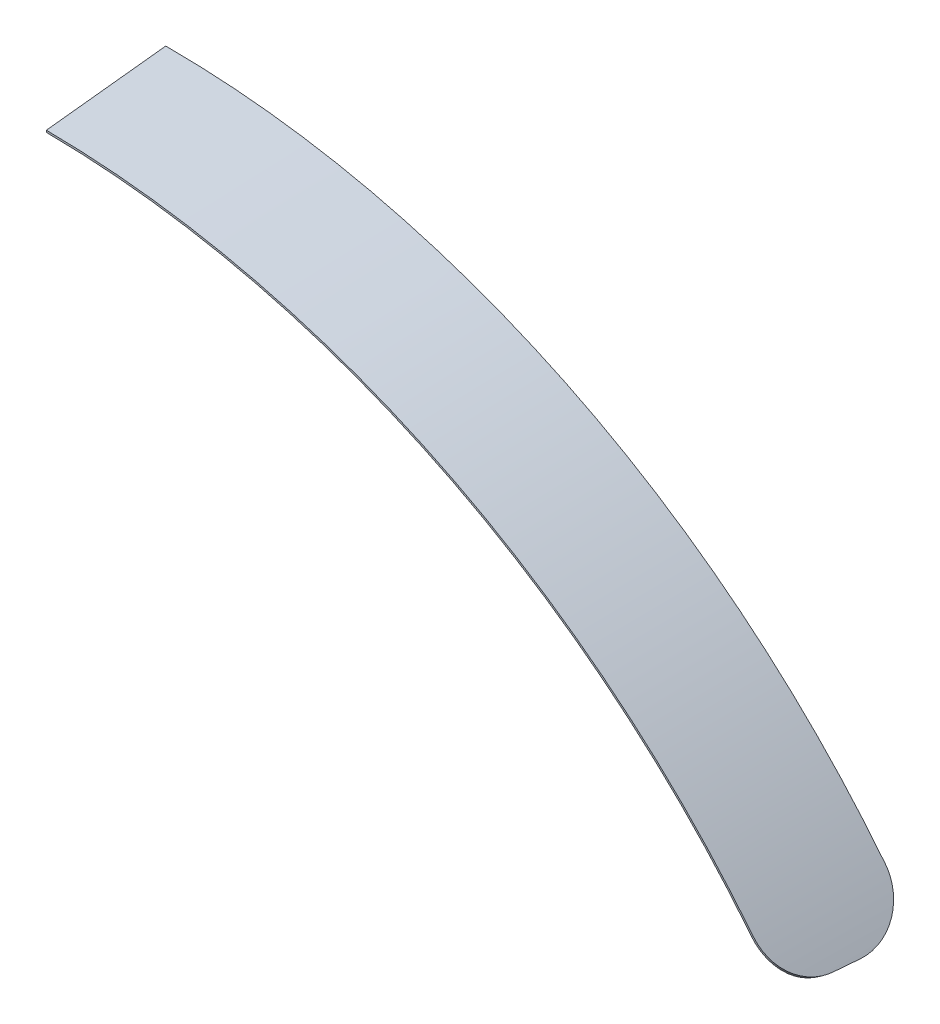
ISO-10303-21;
HEADER;
FILE_DESCRIPTION(('STEP AP214'),'2;1');
FILE_NAME('part.step','',(''),(''),'','','');
FILE_SCHEMA(('AUTOMOTIVE_DESIGN { 1 0 10303 214 1 1 1 1 }'));
ENDSEC;
DATA;
#1=APPLICATION_CONTEXT('core data for automotive mechanical design processes');
#2=APPLICATION_PROTOCOL_DEFINITION('international standard','automotive_design',2000,#1);
#3=PRODUCT_CONTEXT('',#1,'mechanical');
#4=PRODUCT('Part','Part','',(#3));
#5=PRODUCT_RELATED_PRODUCT_CATEGORY('part','',(#4));
#6=PRODUCT_DEFINITION_FORMATION('','',#4);
#7=PRODUCT_DEFINITION_CONTEXT('part definition',#1,'design');
#8=PRODUCT_DEFINITION('design','',#6,#7);
#9=PRODUCT_DEFINITION_SHAPE('','',#8);
#10=(LENGTH_UNIT() NAMED_UNIT(*) SI_UNIT(.MILLI.,.METRE.));
#11=(NAMED_UNIT(*) PLANE_ANGLE_UNIT() SI_UNIT($,.RADIAN.));
#12=(NAMED_UNIT(*) SI_UNIT($,.STERADIAN.) SOLID_ANGLE_UNIT());
#13=UNCERTAINTY_MEASURE_WITH_UNIT(LENGTH_MEASURE(1.E-05),#10,'distance_accuracy_value','');
#14=(GEOMETRIC_REPRESENTATION_CONTEXT(3) GLOBAL_UNCERTAINTY_ASSIGNED_CONTEXT((#13)) GLOBAL_UNIT_ASSIGNED_CONTEXT((#10,
#11,#12)) REPRESENTATION_CONTEXT('',''));
#15=CARTESIAN_POINT('',(0.,0.,0.));
#16=DIRECTION('',(0.,0.,1.));
#17=DIRECTION('',(1.,0.,0.));
#18=AXIS2_PLACEMENT_3D('',#15,#16,#17);
#19=CARTESIAN_POINT('',(0.,0.,0.));
#20=DIRECTION('',(0.,0.,1.));
#21=DIRECTION('',(1.,0.,0.));
#22=AXIS2_PLACEMENT_3D('',#19,#20,#21);
#23=CONICAL_SURFACE('',#22,179.,0.05235987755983);
#24=CARTESIAN_POINT('',(146.946068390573,104.492196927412,25.));
#25=CARTESIAN_POINT('',(146.893739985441,104.188978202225,20.8332922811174));
#26=CARTESIAN_POINT('',(146.841088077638,103.885534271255,16.6666050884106));
#27=CARTESIAN_POINT('',(146.735137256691,103.27819599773,8.33327175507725));
#28=CARTESIAN_POINT('',(146.681838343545,102.974301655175,4.16662561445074));
#29=CARTESIAN_POINT('',(146.62821592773,102.670182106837,0.));
#30=B_SPLINE_CURVE_WITH_KNOTS('',3,(#24,#25,#26,#27,#28,#29),.UNSPECIFIED.,.F.,.F.,(4,2,4),(0.,
12.534161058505,25.0683221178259),.UNSPECIFIED.);
#31=CARTESIAN_POINT('',(146.826495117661,103.802173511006,15.5233595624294));
#32=VERTEX_POINT('',#31);
#33=CARTESIAN_POINT('',(146.762958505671,103.437794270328,10.5233595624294));
#34=VERTEX_POINT('',#33);
#35=EDGE_CURVE('E112',#32,#34,#30,.T.);
#36=ORIENTED_EDGE('',*,*,#35,.F.);
#37=CARTESIAN_POINT('',(146.826495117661,103.802173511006,15.5233595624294));
#38=CARTESIAN_POINT('',(146.830069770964,103.822614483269,15.804306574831));
#39=CARTESIAN_POINT('',(146.826746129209,103.852769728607,16.0846294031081));
#40=CARTESIAN_POINT('',(146.806357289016,103.932159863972,16.6420440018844));
#41=CARTESIAN_POINT('',(146.789292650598,103.981393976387,16.9191359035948));
#42=CARTESIAN_POINT('',(146.741492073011,104.098558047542,17.4679576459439));
#43=CARTESIAN_POINT('',(146.710764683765,104.166476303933,17.7396907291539));
#44=CARTESIAN_POINT('',(146.635790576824,104.320488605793,18.2760439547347));
#45=CARTESIAN_POINT('',(146.591544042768,104.406582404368,18.5406641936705));
#46=CARTESIAN_POINT('',(146.489724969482,104.596333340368,19.0610523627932));
#47=CARTESIAN_POINT('',(146.432145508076,104.699999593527,19.3168156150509));
#48=CARTESIAN_POINT('',(146.303971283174,104.924064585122,19.8175293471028));
#49=CARTESIAN_POINT('',(146.233376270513,105.044463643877,20.0624796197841));
#50=CARTESIAN_POINT('',(146.07956804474,105.301032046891,20.539757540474));
#51=CARTESIAN_POINT('',(145.996357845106,105.437197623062,20.7720881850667));
#52=CARTESIAN_POINT('',(145.81776590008,105.724270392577,21.2225268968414));
#53=CARTESIAN_POINT('',(145.722384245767,105.875177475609,21.4406350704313));
#54=CARTESIAN_POINT('',(145.520165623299,106.1902958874,21.8607001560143));
#55=CARTESIAN_POINT('',(145.41334888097,106.354483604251,22.0626845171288));
#56=CARTESIAN_POINT('',(145.18874461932,106.69513048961,22.4494749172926));
#57=CARTESIAN_POINT('',(145.07095713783,106.8715896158,22.6342810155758));
#58=CARTESIAN_POINT('',(144.825078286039,107.235481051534,22.9854390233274));
#59=CARTESIAN_POINT('',(144.696983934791,107.422916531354,23.1517855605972));
#60=CARTESIAN_POINT('',(144.431310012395,107.807276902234,23.4647621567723));
#61=CARTESIAN_POINT('',(144.293730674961,108.004201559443,23.6113927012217));
#62=CARTESIAN_POINT('',(144.010430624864,108.405364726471,23.8834271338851));
#63=CARTESIAN_POINT('',(143.86473899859,108.609576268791,24.0089010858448));
#64=CARTESIAN_POINT('',(143.565730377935,109.024397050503,24.2383287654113));
#65=CARTESIAN_POINT('',(143.412413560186,109.235006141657,24.3422829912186));
#66=CARTESIAN_POINT('',(143.09928055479,109.660884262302,24.5278679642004));
#67=CARTESIAN_POINT('',(142.939469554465,109.876149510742,24.609516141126));
#68=CARTESIAN_POINT('',(142.614363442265,110.309829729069,24.7500090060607));
#69=CARTESIAN_POINT('',(142.449070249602,110.528243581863,24.8088615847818));
#70=CARTESIAN_POINT('',(142.111818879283,110.969642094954,24.9040329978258));
#71=CARTESIAN_POINT('',(141.939800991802,111.192648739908,24.9400384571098));
#72=CARTESIAN_POINT('',(141.592777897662,111.638278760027,24.9880169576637));
#73=CARTESIAN_POINT('',(141.417778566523,111.860902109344,25.0000327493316));
#74=CARTESIAN_POINT('',(141.241751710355,112.082709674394,25.));
#75=B_SPLINE_CURVE_WITH_KNOTS('',3,(#37,#38,#39,#40,#41,#42,#43,#44,#45,#46,#47,#48,#49,#50,#51,
#52,#53,#54,#55,#56,#57,#58,#59,#60,#61,#62,#63,#64,#65,#66,#67,#68,#69,#70,#71,#72,#73,#74),
.UNSPECIFIED.,.F.,.F.,(4,2,2,2,2,2,2,2,2,2,2,2,2,2,2,2,2,2,4),(0.,0.844880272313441,
1.68972611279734,2.53404400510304,3.37835042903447,4.22309618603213,5.06785811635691,
5.91241856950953,6.75697270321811,7.60005696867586,8.44313832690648,9.28646440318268,
10.1297697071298,10.9702249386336,11.8106607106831,12.6504378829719,13.4899241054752,
14.3406892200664,15.1899368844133),.UNSPECIFIED.);
#76=CARTESIAN_POINT('',(141.241751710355,112.082709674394,25.));
#77=VERTEX_POINT('',#76);
#78=EDGE_CURVE('E152',#32,#77,#75,.T.);
#79=ORIENTED_EDGE('',*,*,#78,.T.);
#80=CARTESIAN_POINT('',(0.,0.,25.));
#81=DIRECTION('',(0.,0.,1.));
#82=DIRECTION('',(1.,0.,0.));
#83=AXIS2_PLACEMENT_3D('',#80,#81,#82);
#84=CIRCLE('',#83,180.310194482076);
#85=CARTESIAN_POINT('',(1.31019448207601,180.305434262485,25.));
#86=VERTEX_POINT('',#85);
#87=EDGE_CURVE('E106',#86,#77,#84,.F.);
#88=ORIENTED_EDGE('',*,*,#87,.F.);
#89=CARTESIAN_POINT('',(1.31019448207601,180.305434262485,25.));
#90=CARTESIAN_POINT('',(1.09182658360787,180.088650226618,20.8332922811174));
#91=CARTESIAN_POINT('',(0.873459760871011,179.871472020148,16.6666050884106));
#92=CARTESIAN_POINT('',(0.436728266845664,179.436327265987,8.33327175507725));
#93=CARTESIAN_POINT('',(0.218363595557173,179.218360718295,4.16662561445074));
#94=CARTESIAN_POINT('',(0.,179.,0.));
#95=B_SPLINE_CURVE_WITH_KNOTS('',3,(#89,#90,#91,#92,#93,#94),.UNSPECIFIED.,.F.,.F.,(4,2,4),(0.,
12.534161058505,25.0683221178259),.UNSPECIFIED.);
#96=CARTESIAN_POINT('',(0.,179.,0.));
#97=VERTEX_POINT('',#96);
#98=EDGE_CURVE('E96',#86,#97,#95,.T.);
#99=ORIENTED_EDGE('',*,*,#98,.T.);
#100=CARTESIAN_POINT('',(0.,0.,0.));
#101=DIRECTION('',(0.,0.,1.));
#102=DIRECTION('',(1.,0.,0.));
#103=AXIS2_PLACEMENT_3D('',#100,#101,#102);
#104=CIRCLE('',#103,179.);
#105=CARTESIAN_POINT('',(140.329674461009,111.124175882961,0.));
#106=VERTEX_POINT('',#105);
#107=EDGE_CURVE('E101',#97,#106,#104,.F.);
#108=ORIENTED_EDGE('',*,*,#107,.T.);
#109=CARTESIAN_POINT('',(140.329674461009,111.124175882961,0.));
#110=CARTESIAN_POINT('',(140.504832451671,110.902991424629,-3.01406849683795E-05));
#111=CARTESIAN_POINT('',(140.679945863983,110.681776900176,0.0118977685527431));
#112=CARTESIAN_POINT('',(141.028865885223,110.240885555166,0.0594536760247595));
#113=CARTESIAN_POINT('',(141.202672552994,110.0212086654,0.0950806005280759));
#114=CARTESIAN_POINT('',(141.547646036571,109.585136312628,0.189782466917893));
#115=CARTESIAN_POINT('',(141.718814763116,109.368738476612,0.248839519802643));
#116=CARTESIAN_POINT('',(142.057485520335,108.940636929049,0.389975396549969));
#117=CARTESIAN_POINT('',(142.224987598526,108.728933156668,0.472053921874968));
#118=CARTESIAN_POINT('',(142.555291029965,108.311677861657,0.658701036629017));
#119=CARTESIAN_POINT('',(142.718090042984,108.106129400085,0.763280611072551));
#120=CARTESIAN_POINT('',(143.037838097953,107.702824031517,0.994165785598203));
#121=CARTESIAN_POINT('',(143.194787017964,107.505067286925,1.12047183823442));
#122=CARTESIAN_POINT('',(143.501795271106,107.118873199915,1.3938879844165));
#123=CARTESIAN_POINT('',(143.651855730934,106.930434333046,1.54099465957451));
#124=CARTESIAN_POINT('',(143.944164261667,106.564276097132,1.85497922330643));
#125=CARTESIAN_POINT('',(144.08641237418,106.386556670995,2.0218570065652));
#126=CARTESIAN_POINT('',(144.362167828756,106.043254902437,2.37413812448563));
#127=CARTESIAN_POINT('',(144.495677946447,105.877668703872,2.55953552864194));
#128=CARTESIAN_POINT('',(144.753189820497,105.559850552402,2.9475777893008));
#129=CARTESIAN_POINT('',(144.877191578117,105.407618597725,3.15022264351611));
#130=CARTESIAN_POINT('',(145.114951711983,105.11767795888,3.57133618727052));
#131=CARTESIAN_POINT('',(145.228708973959,104.979970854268,3.78980659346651));
#132=CARTESIAN_POINT('',(145.44528660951,104.720178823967,4.24098937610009));
#133=CARTESIAN_POINT('',(145.548107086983,104.598093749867,4.47370161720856));
#134=CARTESIAN_POINT('',(145.742195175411,104.370519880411,4.9516783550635));
#135=CARTESIAN_POINT('',(145.833464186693,104.265029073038,5.19694132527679));
#136=CARTESIAN_POINT('',(146.003929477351,104.071463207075,5.69828968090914));
#137=CARTESIAN_POINT('',(146.083126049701,103.983387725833,5.95437480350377));
#138=CARTESIAN_POINT('',(146.228976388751,103.825363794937,6.47549577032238));
#139=CARTESIAN_POINT('',(146.295632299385,103.755412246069,6.74053007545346));
#140=CARTESIAN_POINT('',(146.416026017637,103.634182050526,7.2776830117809));
#141=CARTESIAN_POINT('',(146.469765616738,103.582900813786,7.54980065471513));
#142=CARTESIAN_POINT('',(146.55482027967,103.507561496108,8.04554704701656));
#143=CARTESIAN_POINT('',(146.588464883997,103.480143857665,8.26827577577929));
#144=CARTESIAN_POINT('',(146.647062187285,103.437802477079,8.71602938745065));
#145=CARTESIAN_POINT('',(146.672016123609,103.422876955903,8.94105393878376));
#146=CARTESIAN_POINT('',(146.713121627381,103.405605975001,9.39222094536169));
#147=CARTESIAN_POINT('',(146.729279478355,103.403251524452,9.61836248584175));
#148=CARTESIAN_POINT('',(146.752761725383,103.41110090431,10.0709220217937));
#149=CARTESIAN_POINT('',(146.760084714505,103.421306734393,10.2973400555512));
#150=CARTESIAN_POINT('',(146.762958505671,103.437794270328,10.5233595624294));
#151=B_SPLINE_CURVE_WITH_KNOTS('',3,(#109,#110,#111,#112,#113,#114,#115,#116,#117,#118,#119,
#120,#121,#122,#123,#124,#125,#126,#127,#128,#129,#130,#131,#132,#133,#134,#135,#136,#137,#138,
#139,#140,#141,#142,#143,#144,#145,#146,#147,#148,#149,#150),.UNSPECIFIED.,.F.,.F.,(4,2,2,2,2,2,
2,2,2,2,2,2,2,2,2,2,2,2,2,2,4),(0.,0.846161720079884,1.6922851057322,2.53776371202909,
3.38323135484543,4.22911269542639,5.07501165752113,5.92077176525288,6.76652736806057,
7.61201299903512,8.45749851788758,9.30307588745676,10.148645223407,10.9941119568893,
11.8395581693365,12.6848597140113,13.5300439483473,14.2102988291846,14.8904568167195,
15.5701282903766,16.249907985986),.UNSPECIFIED.);
#152=EDGE_CURVE('E146',#106,#34,#151,.T.);
#153=ORIENTED_EDGE('',*,*,#152,.T.);
#154=EDGE_LOOP('',(#36,#79,#88,#99,#108,#153));
#155=FACE_BOUND('',#154,.T.);
#156=ADVANCED_FACE('F31',(#155),#23,.F.);
#157=CARTESIAN_POINT('',(149.085672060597,104.39091141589,0.));
#158=DIRECTION('',(0.572790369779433,-0.818029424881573,0.0523359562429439));
#159=DIRECTION('',(0.819152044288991,0.573576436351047,0.));
#160=AXIS2_PLACEMENT_3D('',#157,#158,#159);
#161=PLANE('',#160);
#162=CARTESIAN_POINT('',(147.257035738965,104.709938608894,25.));
#163=CARTESIAN_POINT('',(147.56245629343,104.657223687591,20.8333748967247));
#164=CARTESIAN_POINT('',(147.867552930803,104.604280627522,16.6667290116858));
#165=CARTESIAN_POINT('',(148.477098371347,104.497938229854,8.33339567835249));
#166=CARTESIAN_POINT('',(148.781547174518,104.444538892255,4.16670823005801));
#167=CARTESIAN_POINT('',(149.085672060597,104.39091141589,0.));
#168=B_SPLINE_CURVE_WITH_KNOTS('',3,(#162,#163,#164,#165,#166,#167),.UNSPECIFIED.,.F.,.F.,(4,2,
4),(0.,12.5344095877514,25.0688191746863),.UNSPECIFIED.);
#169=CARTESIAN_POINT('',(147.951128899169,104.589650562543,15.5233595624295));
#170=VERTEX_POINT('',#169);
#171=CARTESIAN_POINT('',(148.316887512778,104.525867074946,10.5233595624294));
#172=VERTEX_POINT('',#171);
#173=EDGE_CURVE('E95',#170,#172,#168,.T.);
#174=ORIENTED_EDGE('',*,*,#173,.F.);
#175=DIRECTION('',(-0.819152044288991,-0.573576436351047,0.));
#176=VECTOR('',#175,1.);
#177=CARTESIAN_POINT('',(148.619041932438,105.057328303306,15.5233595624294));
#178=LINE('',#177,#176);
#179=EDGE_CURVE('E143',#170,#32,#178,.T.);
#180=ORIENTED_EDGE('',*,*,#179,.T.);
#181=ORIENTED_EDGE('',*,*,#35,.T.);
#182=DIRECTION('',(-0.819152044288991,-0.573576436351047,0.));
#183=VECTOR('',#182,1.);
#184=CARTESIAN_POINT('',(148.769341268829,104.842678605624,10.5233595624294));
#185=LINE('',#184,#183);
#186=EDGE_CURVE('E120',#34,#172,#185,.F.);
#187=ORIENTED_EDGE('',*,*,#186,.T.);
#188=EDGE_LOOP('',(#174,#180,#181,#187));
#189=FACE_BOUND('',#188,.T.);
#190=ADVANCED_FACE('F126',(#189),#161,.T.);
#191=CARTESIAN_POINT('',(0.,0.,0.));
#192=DIRECTION('',(0.,0.,-1.));
#193=DIRECTION('',(-1.,0.,0.));
#194=AXIS2_PLACEMENT_3D('',#191,#192,#193);
#195=CONICAL_SURFACE('',#194,182.,0.05235987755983);
#196=CARTESIAN_POINT('',(0.,0.,25.));
#197=DIRECTION('',(0.,0.,1.));
#198=DIRECTION('',(1.,0.,0.));
#199=AXIS2_PLACEMENT_3D('',#196,#197,#198);
#200=CIRCLE('',#199,180.689805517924);
#201=CARTESIAN_POINT('',(1.31019448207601,180.685055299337,25.));
#202=VERTEX_POINT('',#201);
#203=CARTESIAN_POINT('',(141.553268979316,112.300836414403,25.));
#204=VERTEX_POINT('',#203);
#205=EDGE_CURVE('E108',#202,#204,#200,.F.);
#206=ORIENTED_EDGE('',*,*,#205,.T.);
#207=CARTESIAN_POINT('',(141.553268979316,112.300836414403,25.));
#208=CARTESIAN_POINT('',(141.728641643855,112.079790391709,25.0000301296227));
#209=CARTESIAN_POINT('',(141.903974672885,111.858718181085,24.9881014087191));
#210=CARTESIAN_POINT('',(142.253342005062,111.418117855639,24.9405423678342));
#211=CARTESIAN_POINT('',(142.427376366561,111.198589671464,24.9049131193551));
#212=CARTESIAN_POINT('',(142.772820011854,110.762808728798,24.8102028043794));
#213=CARTESIAN_POINT('',(142.944231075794,110.546553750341,24.7511384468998));
#214=CARTESIAN_POINT('',(143.28339016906,110.118742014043,24.6099842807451));
#215=CARTESIAN_POINT('',(143.451138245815,109.907185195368,24.5278947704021));
#216=CARTESIAN_POINT('',(143.781936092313,109.490225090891,24.341221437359));
#217=CARTESIAN_POINT('',(143.944983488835,109.284824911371,24.2366264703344));
#218=CARTESIAN_POINT('',(144.265226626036,108.881817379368,24.0057067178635));
#219=CARTESIAN_POINT('',(144.422422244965,108.684210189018,23.8793814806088));
#220=CARTESIAN_POINT('',(144.729909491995,108.298327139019,23.6059320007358));
#221=CARTESIAN_POINT('',(144.88020268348,108.110049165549,23.4588124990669));
#222=CARTESIAN_POINT('',(145.172970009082,107.744209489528,23.1448013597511));
#223=CARTESIAN_POINT('',(145.315444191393,107.566647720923,22.9779098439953));
#224=CARTESIAN_POINT('',(145.591631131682,107.223669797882,22.6256144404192));
#225=CARTESIAN_POINT('',(145.725347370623,107.058248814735,22.4402179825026));
#226=CARTESIAN_POINT('',(145.98326077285,106.740751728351,22.0521792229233));
#227=CARTESIAN_POINT('',(146.107457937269,106.588675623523,21.8495369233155));
#228=CARTESIAN_POINT('',(146.345621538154,106.299003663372,21.4283836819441));
#229=CARTESIAN_POINT('',(146.459584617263,106.161412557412,21.2098675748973));
#230=CARTESIAN_POINT('',(146.676551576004,105.901847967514,20.7585913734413));
#231=CARTESIAN_POINT('',(146.779555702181,105.779874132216,20.5258315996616));
#232=CARTESIAN_POINT('',(146.974012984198,105.552485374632,20.0476933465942));
#233=CARTESIAN_POINT('',(147.065464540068,105.447072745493,19.8023131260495));
#234=CARTESIAN_POINT('',(147.236262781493,105.253663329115,19.3007220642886));
#235=CARTESIAN_POINT('',(147.315609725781,105.165666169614,19.0445114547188));
#236=CARTESIAN_POINT('',(147.461678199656,105.007850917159,18.5233004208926));
#237=CARTESIAN_POINT('',(147.528410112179,104.938017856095,18.258307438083));
#238=CARTESIAN_POINT('',(147.648921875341,104.817012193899,17.7213140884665));
#239=CARTESIAN_POINT('',(147.702706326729,104.765832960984,17.4493162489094));
#240=CARTESIAN_POINT('',(147.796540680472,104.682956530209,16.9030409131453));
#241=CARTESIAN_POINT('',(147.83672875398,104.651060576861,16.6288172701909));
#242=CARTESIAN_POINT('',(147.90386392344,104.606178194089,16.0777168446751));
#243=CARTESIAN_POINT('',(147.93083434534,104.593158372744,15.8008456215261));
#244=CARTESIAN_POINT('',(147.951128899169,104.589650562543,15.5233595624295));
#245=B_SPLINE_CURVE_WITH_KNOTS('',3,(#207,#208,#209,#210,#211,#212,#213,#214,#215,#216,#217,
#218,#219,#220,#221,#222,#223,#224,#225,#226,#227,#228,#229,#230,#231,#232,#233,#234,#235,#236,
#237,#238,#239,#240,#241,#242,#243,#244),.UNSPECIFIED.,.F.,.F.,(4,2,2,2,2,2,2,2,2,2,2,2,2,2,2,2,
2,2,4),(0.,0.846236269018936,1.69243428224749,2.5380300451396,3.38361485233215,4.22961934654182,
5.0756414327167,5.92147094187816,6.76729523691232,7.61278128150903,8.45826722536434,
9.30402953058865,10.1497728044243,10.9956330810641,11.8414752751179,12.6866182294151,
13.5314604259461,14.3674392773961,15.2019374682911),.UNSPECIFIED.);
#246=EDGE_CURVE('E40',#204,#170,#245,.T.);
#247=ORIENTED_EDGE('',*,*,#246,.T.);
#248=ORIENTED_EDGE('',*,*,#173,.T.);
#249=CARTESIAN_POINT('',(148.316887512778,104.525867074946,10.5233595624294));
#250=CARTESIAN_POINT('',(148.337454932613,104.52224760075,10.2422585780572));
#251=CARTESIAN_POINT('',(148.351184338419,104.528401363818,9.96053690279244));
#252=CARTESIAN_POINT('',(148.364929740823,104.560093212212,9.39786218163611));
#253=CARTESIAN_POINT('',(148.364946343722,104.58563044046,9.11690910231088));
#254=CARTESIAN_POINT('',(148.351235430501,104.655901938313,8.55795393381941));
#255=CARTESIAN_POINT('',(148.337517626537,104.700622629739,8.27994989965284));
#256=CARTESIAN_POINT('',(148.296409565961,104.808905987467,7.72866608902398));
#257=CARTESIAN_POINT('',(148.269019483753,104.87246841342,7.45538625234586));
#258=CARTESIAN_POINT('',(148.200676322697,105.017983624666,6.9153524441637));
#259=CARTESIAN_POINT('',(148.159716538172,105.09994549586,6.64860176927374));
#260=CARTESIAN_POINT('',(148.064440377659,105.281609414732,6.12365753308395));
#261=CARTESIAN_POINT('',(148.010123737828,105.381311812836,5.86546414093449));
#262=CARTESIAN_POINT('',(147.888424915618,105.597667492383,5.35951946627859));
#263=CARTESIAN_POINT('',(147.821044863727,105.714318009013,5.11176648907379));
#264=CARTESIAN_POINT('',(147.673573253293,105.96368033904,4.62842646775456));
#265=CARTESIAN_POINT('',(147.593481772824,106.096392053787,4.39283934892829));
#266=CARTESIAN_POINT('',(147.42112460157,106.376693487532,3.9357744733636));
#267=CARTESIAN_POINT('',(147.328872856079,106.524266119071,3.7142809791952));
#268=CARTESIAN_POINT('',(147.132644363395,106.833279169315,3.28669724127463));
#269=CARTESIAN_POINT('',(147.028667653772,106.994719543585,3.08060694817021));
#270=CARTESIAN_POINT('',(146.809582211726,107.330240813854,2.6852930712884));
#271=CARTESIAN_POINT('',(146.694472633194,107.504322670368,2.49607077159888));
#272=CARTESIAN_POINT('',(146.453813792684,107.863778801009,2.13587415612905));
#273=CARTESIAN_POINT('',(146.32826465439,108.049152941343,1.96489962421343));
#274=CARTESIAN_POINT('',(146.067932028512,108.429135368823,1.64297134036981));
#275=CARTESIAN_POINT('',(145.933181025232,108.62371049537,1.49195217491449));
#276=CARTESIAN_POINT('',(145.654913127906,109.021190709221,1.21034525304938));
#277=CARTESIAN_POINT('',(145.511396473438,109.224095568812,1.07975693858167));
#278=CARTESIAN_POINT('',(145.216535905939,109.636674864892,0.839958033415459));
#279=CARTESIAN_POINT('',(145.065193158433,109.846348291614,0.730744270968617));
#280=CARTESIAN_POINT('',(144.755660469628,110.270907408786,0.534454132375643));
#281=CARTESIAN_POINT('',(144.597471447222,110.48579239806,0.447374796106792));
#282=CARTESIAN_POINT('',(144.305296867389,110.878831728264,0.310044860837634));
#283=CARTESIAN_POINT('',(144.172284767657,111.05638057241,0.255956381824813));
#284=CARTESIAN_POINT('',(143.903032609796,111.412998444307,0.163079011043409));
#285=CARTESIAN_POINT('',(143.766792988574,111.592067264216,0.124288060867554));
#286=CARTESIAN_POINT('',(143.491786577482,111.950755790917,0.0621939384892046));
#287=CARTESIAN_POINT('',(143.353021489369,112.13037506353,0.0388807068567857));
#288=CARTESIAN_POINT('',(143.073501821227,112.4894519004,0.00777594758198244));
#289=CARTESIAN_POINT('',(142.932746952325,112.668909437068,-1.33025099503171E-05));
#290=CARTESIAN_POINT('',(142.791329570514,112.847845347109,0.));
#291=B_SPLINE_CURVE_WITH_KNOTS('',3,(#249,#250,#251,#252,#253,#254,#255,#256,#257,#258,#259,
#260,#261,#262,#263,#264,#265,#266,#267,#268,#269,#270,#271,#272,#273,#274,#275,#276,#277,#278,
#279,#280,#281,#282,#283,#284,#285,#286,#287,#288,#289,#290),.UNSPECIFIED.,.F.,.F.,(4,2,2,2,2,2,
2,2,2,2,2,2,2,2,2,2,2,2,2,2,4),(0.,0.845369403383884,1.69070142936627,2.53543610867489,
3.3801600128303,4.22530197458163,5.07046063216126,5.9154815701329,6.76049731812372,
7.60455230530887,8.44860458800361,9.29272106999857,10.1368275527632,10.9780945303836,
11.8193385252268,12.6604575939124,13.5014641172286,14.1859804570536,14.8704046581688,
15.5543835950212,16.2384628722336),.UNSPECIFIED.);
#292=CARTESIAN_POINT('',(142.791329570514,112.847845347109,0.));
#293=VERTEX_POINT('',#292);
#294=EDGE_CURVE('E47',#172,#293,#291,.T.);
#295=ORIENTED_EDGE('',*,*,#294,.T.);
#296=CARTESIAN_POINT('',(0.,0.,0.));
#297=DIRECTION('',(0.,0.,-1.));
#298=DIRECTION('',(-1.,0.,0.));
#299=AXIS2_PLACEMENT_3D('',#296,#297,#298);
#300=CIRCLE('',#299,182.);
#301=CARTESIAN_POINT('',(0.,182.,0.));
#302=VERTEX_POINT('',#301);
#303=EDGE_CURVE('E98',#302,#293,#300,.T.);
#304=ORIENTED_EDGE('',*,*,#303,.F.);
#305=CARTESIAN_POINT('',(1.31019448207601,180.685055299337,25.));
#306=CARTESIAN_POINT('',(1.09183091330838,180.905005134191,20.8333748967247));
#307=CARTESIAN_POINT('',(0.873466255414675,181.124558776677,16.6667290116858));
#308=CARTESIAN_POINT('',(0.436734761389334,181.562873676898,8.33339567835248));
#309=CARTESIAN_POINT('',(0.218367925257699,181.781634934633,4.16670823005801));
#310=CARTESIAN_POINT('',(0.,182.,0.));
#311=B_SPLINE_CURVE_WITH_KNOTS('',3,(#305,#306,#307,#308,#309,#310),.UNSPECIFIED.,.F.,.F.,(4,2,
4),(0.,12.5344095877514,25.0688191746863),.UNSPECIFIED.);
#312=EDGE_CURVE('E89',#202,#302,#311,.T.);
#313=ORIENTED_EDGE('',*,*,#312,.F.);
#314=EDGE_LOOP('',(#206,#247,#248,#295,#304,#313));
#315=FACE_BOUND('',#314,.T.);
#316=ADVANCED_FACE('F33',(#315),#195,.T.);
#317=CARTESIAN_POINT('',(0.,179.,0.));
#318=DIRECTION('',(-0.998629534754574,0.,0.0523359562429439));
#319=DIRECTION('',(0.052335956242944,0.,0.998629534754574));
#320=AXIS2_PLACEMENT_3D('',#317,#318,#319);
#321=PLANE('',#320);
#322=DIRECTION('',(0.,1.,0.));
#323=VECTOR('',#322,1.);
#324=CARTESIAN_POINT('',(0.,179.,0.));
#325=LINE('',#324,#323);
#326=EDGE_CURVE('E92',#97,#302,#325,.T.);
#327=ORIENTED_EDGE('',*,*,#326,.F.);
#328=ORIENTED_EDGE('',*,*,#98,.F.);
#329=DIRECTION('',(0.,1.,0.));
#330=VECTOR('',#329,1.);
#331=CARTESIAN_POINT('',(1.310194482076,179.,25.));
#332=LINE('',#331,#330);
#333=EDGE_CURVE('E94',#86,#202,#332,.T.);
#334=ORIENTED_EDGE('',*,*,#333,.T.);
#335=ORIENTED_EDGE('',*,*,#312,.T.);
#336=EDGE_LOOP('',(#327,#328,#334,#335));
#337=FACE_BOUND('',#336,.T.);
#338=ADVANCED_FACE('F90',(#337),#321,.T.);
#339=CARTESIAN_POINT('',(0.,0.,25.));
#340=DIRECTION('',(0.,0.,1.));
#341=DIRECTION('',(1.,0.,0.));
#342=AXIS2_PLACEMENT_3D('',#339,#340,#341);
#343=PLANE('',#342);
#344=ORIENTED_EDGE('',*,*,#87,.T.);
#345=DIRECTION('',(-0.819152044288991,-0.573576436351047,0.));
#346=VECTOR('',#345,1.);
#347=CARTESIAN_POINT('',(-6.19453382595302,8.84671113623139,25.));
#348=LINE('',#347,#346);
#349=EDGE_CURVE('E55',#77,#204,#348,.F.);
#350=ORIENTED_EDGE('',*,*,#349,.T.);
#351=ORIENTED_EDGE('',*,*,#205,.F.);
#352=ORIENTED_EDGE('',*,*,#333,.F.);
#353=EDGE_LOOP('',(#344,#350,#351,#352));
#354=FACE_BOUND('',#353,.T.);
#355=ADVANCED_FACE('F181',(#354),#343,.T.);
#356=CARTESIAN_POINT('',(0.,0.,0.));
#357=DIRECTION('',(0.,0.,1.));
#358=DIRECTION('',(1.,0.,0.));
#359=AXIS2_PLACEMENT_3D('',#356,#357,#358);
#360=PLANE('',#359);
#361=ORIENTED_EDGE('',*,*,#303,.T.);
#362=DIRECTION('',(-0.819152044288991,-0.573576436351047,0.));
#363=VECTOR('',#362,1.);
#364=CARTESIAN_POINT('',(140.583981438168,111.302243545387,0.));
#365=LINE('',#364,#363);
#366=EDGE_CURVE('E11',#293,#106,#365,.T.);
#367=ORIENTED_EDGE('',*,*,#366,.T.);
#368=ORIENTED_EDGE('',*,*,#107,.F.);
#369=ORIENTED_EDGE('',*,*,#326,.T.);
#370=EDGE_LOOP('',(#361,#367,#368,#369));
#371=FACE_BOUND('',#370,.T.);
#372=ADVANCED_FACE('F104',(#371),#360,.F.);
#373=CARTESIAN_POINT('',(142.891138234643,113.237622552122,15.));
#374=DIRECTION('',(-0.819152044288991,-0.573576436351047,0.));
#375=DIRECTION('',(0.573576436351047,-0.819152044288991,0.));
#376=AXIS2_PLACEMENT_3D('',#373,#374,#375);
#377=CYLINDRICAL_SURFACE('',#376,10.);
#378=ORIENTED_EDGE('',*,*,#246,.F.);
#379=ORIENTED_EDGE('',*,*,#349,.F.);
#380=ORIENTED_EDGE('',*,*,#78,.F.);
#381=ORIENTED_EDGE('',*,*,#179,.F.);
#382=EDGE_LOOP('',(#378,#379,#380,#381));
#383=FACE_BOUND('',#382,.T.);
#384=ADVANCED_FACE('F161',(#383),#377,.T.);
#385=CARTESIAN_POINT('',(-6.04423448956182,8.63206143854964,10.));
#386=DIRECTION('',(0.819152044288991,0.573576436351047,0.));
#387=DIRECTION('',(-0.573576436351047,0.819152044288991,0.));
#388=AXIS2_PLACEMENT_3D('',#385,#386,#387);
#389=CYLINDRICAL_SURFACE('',#388,10.);
#390=ORIENTED_EDGE('',*,*,#294,.F.);
#391=ORIENTED_EDGE('',*,*,#186,.F.);
#392=ORIENTED_EDGE('',*,*,#152,.F.);
#393=ORIENTED_EDGE('',*,*,#366,.F.);
#394=EDGE_LOOP('',(#390,#391,#392,#393));
#395=FACE_BOUND('',#394,.T.);
#396=ADVANCED_FACE('F158',(#395),#389,.T.);
#397=CLOSED_SHELL('',(#156,#190,#316,#338,#355,#372,#384,#396));
#398=MANIFOLD_SOLID_BREP('B2',#397);
#399=ADVANCED_BREP_SHAPE_REPRESENTATION('',(#18,#398),#14);
#400=SHAPE_DEFINITION_REPRESENTATION(#9,#399);
ENDSEC;
END-ISO-10303-21;
